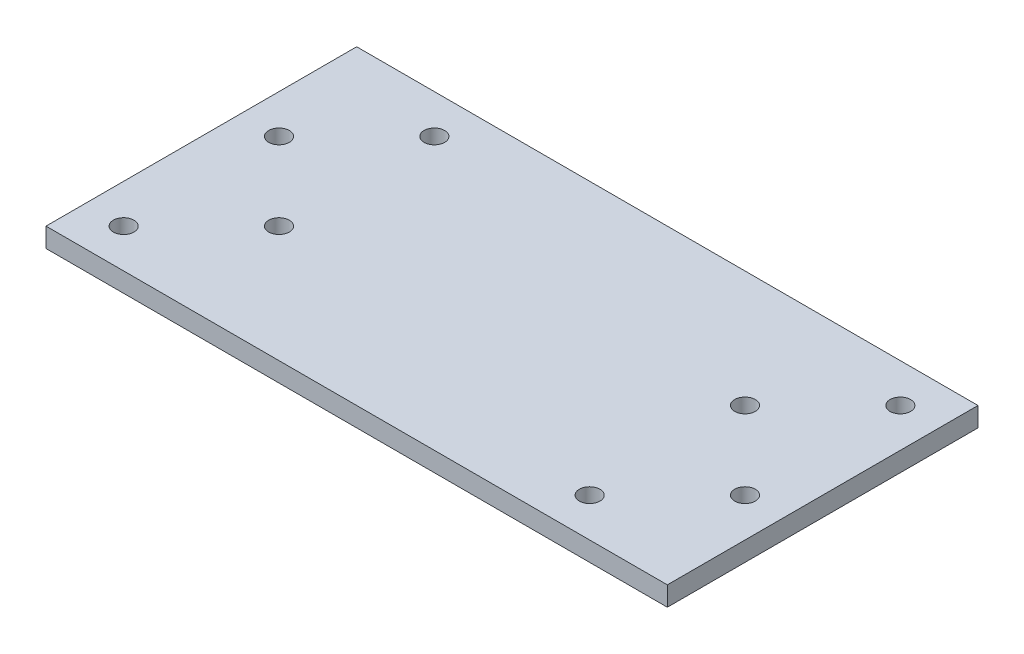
from build123d import *

# Parameters (mm, degrees)
SKETCH1_R      = 3.37312
EXTRUDE1_DEPTH = 6.35


with BuildPart() as part:
    # Sketch1 → Extrude1 (new body)
    with BuildSketch(Plane(origin=(0, 0, 0), x_dir=(1, 0, 0), z_dir=(0, 1, 0))):
        Polygon((0, 0), (203.2, 0), (203.2, 50.8), (203.2, 101.6), (0, 101.6), (0, 50.8), align=None)
        with Locations(Location((12.7, 12.7, 0), (0, 0, 270))):
            Circle(SKETCH1_R, mode=Mode.SUBTRACT)
        with Locations(Location((38.1, 38.1, 0), (0, 0, 270))):
            Circle(SKETCH1_R, mode=Mode.SUBTRACT)
        with Locations(Location((190.5, 38.1, 0), (0, 0, 270))):
            Circle(SKETCH1_R, mode=Mode.SUBTRACT)
        with Locations(Location((165.1, 12.7, 0), (0, 0, 270))):
            Circle(SKETCH1_R, mode=Mode.SUBTRACT)
        with Locations(Location((12.7, 63.5, 0), (0, 0, 270))):
            Circle(SKETCH1_R, mode=Mode.SUBTRACT)
        with Locations(Location((38.1, 88.9, 0), (0, 0, 270))):
            Circle(SKETCH1_R, mode=Mode.SUBTRACT)
        with Locations(Location((190.5, 88.9, 0), (0, 0, 270))):
            Circle(SKETCH1_R, mode=Mode.SUBTRACT)
        with Locations(Location((165.1, 63.5, 0), (0, 0, 270))):
            Circle(SKETCH1_R, mode=Mode.SUBTRACT)
    extrude(amount=EXTRUDE1_DEPTH)


solid = part.part
